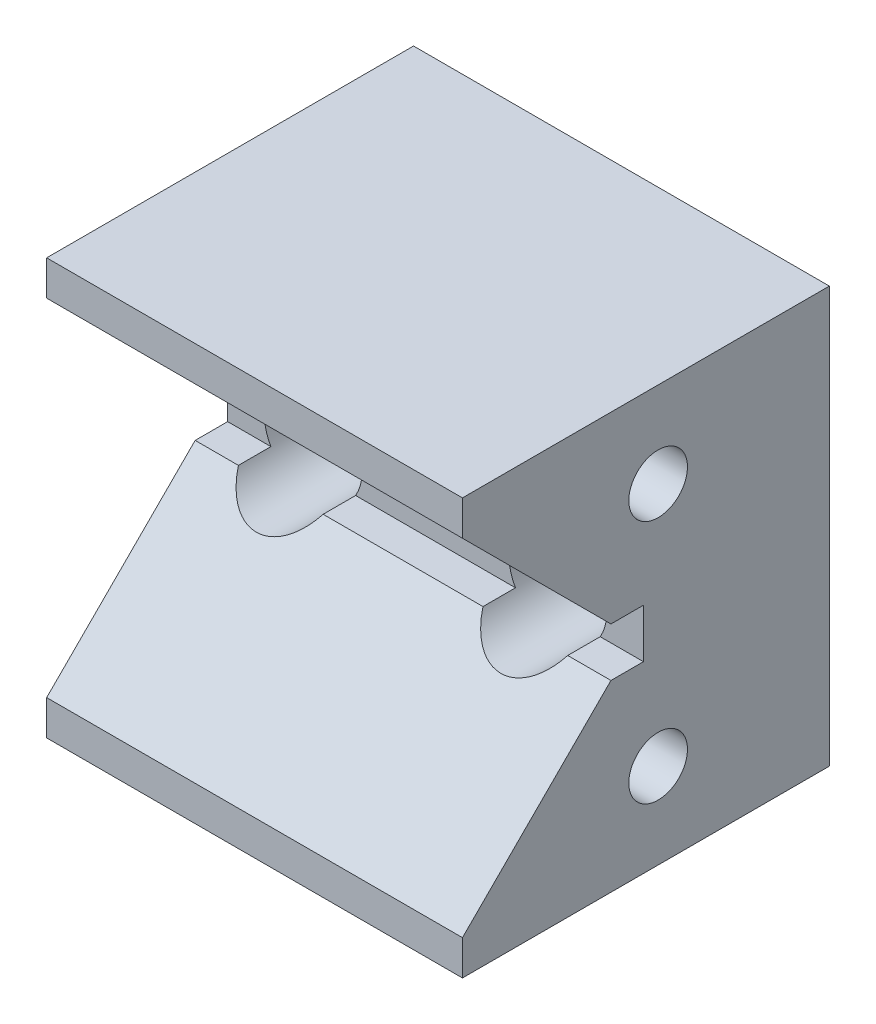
ISO-10303-21;
HEADER;
FILE_DESCRIPTION(('STEP AP214'),'2;1');
FILE_NAME('part.step','',(''),(''),'','','');
FILE_SCHEMA(('AUTOMOTIVE_DESIGN { 1 0 10303 214 1 1 1 1 }'));
ENDSEC;
DATA;
#1=APPLICATION_CONTEXT('core data for automotive mechanical design processes');
#2=APPLICATION_PROTOCOL_DEFINITION('international standard','automotive_design',2000,#1);
#3=PRODUCT_CONTEXT('',#1,'mechanical');
#4=PRODUCT('Part','Part','',(#3));
#5=PRODUCT_RELATED_PRODUCT_CATEGORY('part','',(#4));
#6=PRODUCT_DEFINITION_FORMATION('','',#4);
#7=PRODUCT_DEFINITION_CONTEXT('part definition',#1,'design');
#8=PRODUCT_DEFINITION('design','',#6,#7);
#9=PRODUCT_DEFINITION_SHAPE('','',#8);
#10=(LENGTH_UNIT() NAMED_UNIT(*) SI_UNIT(.MILLI.,.METRE.));
#11=(NAMED_UNIT(*) PLANE_ANGLE_UNIT() SI_UNIT($,.RADIAN.));
#12=(NAMED_UNIT(*) SI_UNIT($,.STERADIAN.) SOLID_ANGLE_UNIT());
#13=UNCERTAINTY_MEASURE_WITH_UNIT(LENGTH_MEASURE(1.E-05),#10,'distance_accuracy_value','');
#14=(GEOMETRIC_REPRESENTATION_CONTEXT(3) GLOBAL_UNCERTAINTY_ASSIGNED_CONTEXT((#13)) GLOBAL_UNIT_ASSIGNED_CONTEXT((#10,
#11,#12)) REPRESENTATION_CONTEXT('',''));
#15=CARTESIAN_POINT('',(0.,0.,0.));
#16=DIRECTION('',(0.,0.,1.));
#17=DIRECTION('',(1.,0.,0.));
#18=AXIS2_PLACEMENT_3D('',#15,#16,#17);
#19=CARTESIAN_POINT('',(67.5,-42.5,0.));
#20=DIRECTION('',(0.,0.,1.));
#21=DIRECTION('',(0.,-1.,0.));
#22=AXIS2_PLACEMENT_3D('',#19,#20,#21);
#23=PLANE('',#22);
#24=CARTESIAN_POINT('',(50.,0.,0.));
#25=DIRECTION('',(0.,0.,-1.));
#26=DIRECTION('',(0.,1.,0.));
#27=AXIS2_PLACEMENT_3D('',#24,#25,#26);
#28=CIRCLE('',#27,6.);
#29=CARTESIAN_POINT('',(50.,6.,0.));
#30=VERTEX_POINT('',#29);
#31=EDGE_CURVE('E272',#30,#30,#28,.T.);
#32=ORIENTED_EDGE('',*,*,#31,.F.);
#33=EDGE_LOOP('',(#32));
#34=FACE_BOUND('',#33,.T.);
#35=DIRECTION('',(-1.,0.,0.));
#36=VECTOR('',#35,1.);
#37=CARTESIAN_POINT('',(67.5,42.5,0.));
#38=LINE('',#37,#36);
#39=CARTESIAN_POINT('',(67.5,42.5,0.));
#40=VERTEX_POINT('',#39);
#41=CARTESIAN_POINT('',(-17.5,42.5,0.));
#42=VERTEX_POINT('',#41);
#43=EDGE_CURVE('E178',#40,#42,#38,.T.);
#44=ORIENTED_EDGE('',*,*,#43,.F.);
#45=DIRECTION('',(0.,1.,0.));
#46=VECTOR('',#45,1.);
#47=CARTESIAN_POINT('',(67.5,-42.5,0.));
#48=LINE('',#47,#46);
#49=CARTESIAN_POINT('',(67.5,-42.5,0.));
#50=VERTEX_POINT('',#49);
#51=EDGE_CURVE('E235',#50,#40,#48,.T.);
#52=ORIENTED_EDGE('',*,*,#51,.F.);
#53=DIRECTION('',(-1.,0.,0.));
#54=VECTOR('',#53,1.);
#55=CARTESIAN_POINT('',(67.5,-42.5,0.));
#56=LINE('',#55,#54);
#57=CARTESIAN_POINT('',(-17.5,-42.5,0.));
#58=VERTEX_POINT('',#57);
#59=EDGE_CURVE('E180',#50,#58,#56,.T.);
#60=ORIENTED_EDGE('',*,*,#59,.T.);
#61=DIRECTION('',(0.,1.,0.));
#62=VECTOR('',#61,1.);
#63=CARTESIAN_POINT('',(-17.5,-42.5,0.));
#64=LINE('',#63,#62);
#65=EDGE_CURVE('E207',#58,#42,#64,.T.);
#66=ORIENTED_EDGE('',*,*,#65,.T.);
#67=EDGE_LOOP('',(#44,#52,#60,#66));
#68=FACE_BOUND('',#67,.T.);
#69=CARTESIAN_POINT('',(0.,0.,0.));
#70=DIRECTION('',(0.,0.,-1.));
#71=DIRECTION('',(0.,1.,0.));
#72=AXIS2_PLACEMENT_3D('',#69,#70,#71);
#73=CIRCLE('',#72,6.);
#74=CARTESIAN_POINT('',(0.,6.,0.));
#75=VERTEX_POINT('',#74);
#76=EDGE_CURVE('E310',#75,#75,#73,.T.);
#77=ORIENTED_EDGE('',*,*,#76,.F.);
#78=EDGE_LOOP('',(#77));
#79=FACE_BOUND('',#78,.T.);
#80=ADVANCED_FACE('F14',(#34,#68,#79),#23,.F.);
#81=CARTESIAN_POINT('',(67.5,35.355,75.));
#82=DIRECTION('',(0.,0.707106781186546,-0.707106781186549));
#83=DIRECTION('',(0.,0.707106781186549,0.707106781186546));
#84=AXIS2_PLACEMENT_3D('',#81,#82,#83);
#85=PLANE('',#84);
#86=CARTESIAN_POINT('',(0.,0.,39.645));
#87=DIRECTION('',(0.,0.707106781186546,-0.707106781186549));
#88=DIRECTION('',(0.,-0.707106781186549,-0.707106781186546));
#89=AXIS2_PLACEMENT_3D('',#86,#87,#88);
#90=ELLIPSE('',#89,14.1421356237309,10.);
#91=CARTESIAN_POINT('',(8.6602540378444,5.,44.645));
#92=VERTEX_POINT('',#91);
#93=CARTESIAN_POINT('',(-8.6602540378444,5.,44.645));
#94=VERTEX_POINT('',#93);
#95=EDGE_CURVE('E328',#92,#94,#90,.F.);
#96=ORIENTED_EDGE('',*,*,#95,.F.);
#97=DIRECTION('',(-1.,0.,0.));
#98=VECTOR('',#97,1.);
#99=CARTESIAN_POINT('',(67.5,5.,44.645));
#100=LINE('',#99,#98);
#101=CARTESIAN_POINT('',(41.3397459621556,5.,44.645));
#102=VERTEX_POINT('',#101);
#103=EDGE_CURVE('E174',#102,#92,#100,.T.);
#104=ORIENTED_EDGE('',*,*,#103,.F.);
#105=CARTESIAN_POINT('',(50.,0.,39.645));
#106=DIRECTION('',(0.,0.707106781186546,-0.707106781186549));
#107=DIRECTION('',(0.,-0.707106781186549,-0.707106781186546));
#108=AXIS2_PLACEMENT_3D('',#105,#106,#107);
#109=ELLIPSE('',#108,14.1421356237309,10.);
#110=CARTESIAN_POINT('',(58.6602540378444,5.,44.645));
#111=VERTEX_POINT('',#110);
#112=EDGE_CURVE('E201',#111,#102,#109,.F.);
#113=ORIENTED_EDGE('',*,*,#112,.F.);
#114=CARTESIAN_POINT('',(67.5,5.,44.645));
#115=VERTEX_POINT('',#114);
#116=EDGE_CURVE('E170',#115,#111,#100,.T.);
#117=ORIENTED_EDGE('',*,*,#116,.F.);
#118=DIRECTION('',(0.,-0.707106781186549,-0.707106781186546));
#119=VECTOR('',#118,1.);
#120=CARTESIAN_POINT('',(67.5,35.355,75.));
#121=LINE('',#120,#119);
#122=CARTESIAN_POINT('',(67.5,35.355,75.));
#123=VERTEX_POINT('',#122);
#124=EDGE_CURVE('E244',#123,#115,#121,.T.);
#125=ORIENTED_EDGE('',*,*,#124,.F.);
#126=DIRECTION('',(-1.,0.,0.));
#127=VECTOR('',#126,1.);
#128=CARTESIAN_POINT('',(67.5,35.355,75.));
#129=LINE('',#128,#127);
#130=CARTESIAN_POINT('',(-17.5,35.355,75.));
#131=VERTEX_POINT('',#130);
#132=EDGE_CURVE('E173',#123,#131,#129,.T.);
#133=ORIENTED_EDGE('',*,*,#132,.T.);
#134=DIRECTION('',(0.,-0.707106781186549,-0.707106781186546));
#135=VECTOR('',#134,1.);
#136=CARTESIAN_POINT('',(-17.5,35.355,75.));
#137=LINE('',#136,#135);
#138=CARTESIAN_POINT('',(-17.5,5.,44.645));
#139=VERTEX_POINT('',#138);
#140=EDGE_CURVE('E221',#131,#139,#137,.T.);
#141=ORIENTED_EDGE('',*,*,#140,.T.);
#142=EDGE_CURVE('E168',#94,#139,#100,.T.);
#143=ORIENTED_EDGE('',*,*,#142,.F.);
#144=EDGE_LOOP('',(#96,#104,#113,#117,#125,#133,#141,#143));
#145=FACE_BOUND('',#144,.T.);
#146=ADVANCED_FACE('F289',(#145),#85,.F.);
#147=CARTESIAN_POINT('',(67.5,5.,38.));
#148=DIRECTION('',(0.,-1.,0.));
#149=DIRECTION('',(0.,0.,-1.));
#150=AXIS2_PLACEMENT_3D('',#147,#148,#149);
#151=PLANE('',#150);
#152=DIRECTION('',(-1.,0.,0.));
#153=VECTOR('',#152,1.);
#154=CARTESIAN_POINT('',(67.5,5.,38.));
#155=LINE('',#154,#153);
#156=CARTESIAN_POINT('',(-8.6602540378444,5.,38.));
#157=VERTEX_POINT('',#156);
#158=CARTESIAN_POINT('',(-17.5,5.,38.));
#159=VERTEX_POINT('',#158);
#160=EDGE_CURVE('E164',#157,#159,#155,.T.);
#161=ORIENTED_EDGE('',*,*,#160,.F.);
#162=DIRECTION('',(0.,0.,-1.));
#163=VECTOR('',#162,1.);
#164=CARTESIAN_POINT('',(-8.6602540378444,5.,0.));
#165=LINE('',#164,#163);
#166=EDGE_CURVE('E325',#157,#94,#165,.F.);
#167=ORIENTED_EDGE('',*,*,#166,.T.);
#168=ORIENTED_EDGE('',*,*,#142,.T.);
#169=DIRECTION('',(0.,0.,1.));
#170=VECTOR('',#169,1.);
#171=CARTESIAN_POINT('',(-17.5,5.,38.));
#172=LINE('',#171,#170);
#173=EDGE_CURVE('E224',#159,#139,#172,.T.);
#174=ORIENTED_EDGE('',*,*,#173,.F.);
#175=EDGE_LOOP('',(#161,#167,#168,#174));
#176=FACE_BOUND('',#175,.T.);
#177=ADVANCED_FACE('F378',(#176),#151,.T.);
#178=ORIENTED_EDGE('',*,*,#103,.T.);
#179=DIRECTION('',(0.,0.,-1.));
#180=VECTOR('',#179,1.);
#181=CARTESIAN_POINT('',(8.6602540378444,5.,0.));
#182=LINE('',#181,#180);
#183=CARTESIAN_POINT('',(8.6602540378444,5.,38.));
#184=VERTEX_POINT('',#183);
#185=EDGE_CURVE('E322',#92,#184,#182,.T.);
#186=ORIENTED_EDGE('',*,*,#185,.T.);
#187=CARTESIAN_POINT('',(41.3397459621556,5.,38.));
#188=VERTEX_POINT('',#187);
#189=EDGE_CURVE('E169',#188,#184,#155,.T.);
#190=ORIENTED_EDGE('',*,*,#189,.F.);
#191=DIRECTION('',(0.,0.,-1.));
#192=VECTOR('',#191,1.);
#193=CARTESIAN_POINT('',(41.3397459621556,5.,0.));
#194=LINE('',#193,#192);
#195=EDGE_CURVE('E278',#188,#102,#194,.F.);
#196=ORIENTED_EDGE('',*,*,#195,.T.);
#197=EDGE_LOOP('',(#178,#186,#190,#196));
#198=FACE_BOUND('',#197,.T.);
#199=ADVANCED_FACE('F376',(#198),#151,.T.);
#200=CARTESIAN_POINT('',(67.5,-5.,38.));
#201=DIRECTION('',(0.,0.,1.));
#202=DIRECTION('',(0.,-1.,0.));
#203=AXIS2_PLACEMENT_3D('',#200,#201,#202);
#204=PLANE('',#203);
#205=DIRECTION('',(-1.,0.,0.));
#206=VECTOR('',#205,1.);
#207=CARTESIAN_POINT('',(67.5,-5.,38.));
#208=LINE('',#207,#206);
#209=CARTESIAN_POINT('',(-8.66025403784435,-5.00000000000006,38.));
#210=VERTEX_POINT('',#209);
#211=CARTESIAN_POINT('',(-17.5,-5.,38.));
#212=VERTEX_POINT('',#211);
#213=EDGE_CURVE('E156',#210,#212,#208,.T.);
#214=ORIENTED_EDGE('',*,*,#213,.F.);
#215=CARTESIAN_POINT('',(0.,0.,38.));
#216=DIRECTION('',(0.,0.,1.));
#217=DIRECTION('',(0.,-1.,0.));
#218=AXIS2_PLACEMENT_3D('',#215,#216,#217);
#219=CIRCLE('',#218,10.);
#220=EDGE_CURVE('E321',#210,#157,#219,.F.);
#221=ORIENTED_EDGE('',*,*,#220,.T.);
#222=ORIENTED_EDGE('',*,*,#160,.T.);
#223=DIRECTION('',(0.,1.,0.));
#224=VECTOR('',#223,1.);
#225=CARTESIAN_POINT('',(-17.5,-5.,38.));
#226=LINE('',#225,#224);
#227=EDGE_CURVE('E227',#212,#159,#226,.T.);
#228=ORIENTED_EDGE('',*,*,#227,.F.);
#229=EDGE_LOOP('',(#214,#221,#222,#228));
#230=FACE_BOUND('',#229,.T.);
#231=ADVANCED_FACE('F372',(#230),#204,.T.);
#232=ORIENTED_EDGE('',*,*,#189,.T.);
#233=CARTESIAN_POINT('',(8.66025403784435,-5.00000000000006,38.));
#234=VERTEX_POINT('',#233);
#235=EDGE_CURVE('E149',#184,#234,#219,.F.);
#236=ORIENTED_EDGE('',*,*,#235,.T.);
#237=CARTESIAN_POINT('',(41.3397459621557,-5.00000000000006,38.));
#238=VERTEX_POINT('',#237);
#239=EDGE_CURVE('E148',#238,#234,#208,.T.);
#240=ORIENTED_EDGE('',*,*,#239,.F.);
#241=CARTESIAN_POINT('',(50.,0.,38.));
#242=DIRECTION('',(0.,0.,1.));
#243=DIRECTION('',(0.,-1.,0.));
#244=AXIS2_PLACEMENT_3D('',#241,#242,#243);
#245=CIRCLE('',#244,10.);
#246=EDGE_CURVE('E270',#238,#188,#245,.F.);
#247=ORIENTED_EDGE('',*,*,#246,.T.);
#248=EDGE_LOOP('',(#232,#236,#240,#247));
#249=FACE_BOUND('',#248,.T.);
#250=ADVANCED_FACE('F375',(#249),#204,.T.);
#251=CARTESIAN_POINT('',(67.5,-5.,44.645));
#252=DIRECTION('',(0.,1.,0.));
#253=DIRECTION('',(0.,0.,1.));
#254=AXIS2_PLACEMENT_3D('',#251,#252,#253);
#255=PLANE('',#254);
#256=ORIENTED_EDGE('',*,*,#239,.T.);
#257=DIRECTION('',(0.,0.,-1.));
#258=VECTOR('',#257,1.);
#259=CARTESIAN_POINT('',(8.66025403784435,-5.00000000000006,0.));
#260=LINE('',#259,#258);
#261=CARTESIAN_POINT('',(8.6602540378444,-5.,44.645));
#262=VERTEX_POINT('',#261);
#263=EDGE_CURVE('E137',#234,#262,#260,.F.);
#264=ORIENTED_EDGE('',*,*,#263,.T.);
#265=DIRECTION('',(-1.,0.,0.));
#266=VECTOR('',#265,1.);
#267=CARTESIAN_POINT('',(67.5,-5.,44.645));
#268=LINE('',#267,#266);
#269=CARTESIAN_POINT('',(41.3397459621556,-5.,44.645));
#270=VERTEX_POINT('',#269);
#271=EDGE_CURVE('E146',#270,#262,#268,.T.);
#272=ORIENTED_EDGE('',*,*,#271,.F.);
#273=DIRECTION('',(0.,0.,-1.));
#274=VECTOR('',#273,1.);
#275=CARTESIAN_POINT('',(41.3397459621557,-5.00000000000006,0.));
#276=LINE('',#275,#274);
#277=EDGE_CURVE('E36',#270,#238,#276,.T.);
#278=ORIENTED_EDGE('',*,*,#277,.T.);
#279=EDGE_LOOP('',(#256,#264,#272,#278));
#280=FACE_BOUND('',#279,.T.);
#281=ADVANCED_FACE('F145',(#280),#255,.T.);
#282=CARTESIAN_POINT('',(-8.6602540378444,-5.,44.645));
#283=VERTEX_POINT('',#282);
#284=CARTESIAN_POINT('',(-17.5,-5.,44.645));
#285=VERTEX_POINT('',#284);
#286=EDGE_CURVE('E154',#283,#285,#268,.T.);
#287=ORIENTED_EDGE('',*,*,#286,.F.);
#288=DIRECTION('',(0.,0.,-1.));
#289=VECTOR('',#288,1.);
#290=CARTESIAN_POINT('',(-8.66025403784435,-5.00000000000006,0.));
#291=LINE('',#290,#289);
#292=EDGE_CURVE('E29',#283,#210,#291,.T.);
#293=ORIENTED_EDGE('',*,*,#292,.T.);
#294=ORIENTED_EDGE('',*,*,#213,.T.);
#295=DIRECTION('',(0.,0.,-1.));
#296=VECTOR('',#295,1.);
#297=CARTESIAN_POINT('',(-17.5,-5.,44.645));
#298=LINE('',#297,#296);
#299=EDGE_CURVE('E230',#285,#212,#298,.T.);
#300=ORIENTED_EDGE('',*,*,#299,.F.);
#301=EDGE_LOOP('',(#287,#293,#294,#300));
#302=FACE_BOUND('',#301,.T.);
#303=ADVANCED_FACE('F368',(#302),#255,.T.);
#304=CARTESIAN_POINT('',(67.5,-35.355,75.));
#305=DIRECTION('',(0.,0.707106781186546,0.707106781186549));
#306=DIRECTION('',(0.,-0.707106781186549,0.707106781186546));
#307=AXIS2_PLACEMENT_3D('',#304,#305,#306);
#308=PLANE('',#307);
#309=ORIENTED_EDGE('',*,*,#271,.T.);
#310=CARTESIAN_POINT('',(0.,0.,39.645));
#311=DIRECTION('',(0.,0.707106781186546,0.707106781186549));
#312=DIRECTION('',(0.,0.707106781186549,-0.707106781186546));
#313=AXIS2_PLACEMENT_3D('',#310,#311,#312);
#314=ELLIPSE('',#313,14.1421356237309,10.);
#315=EDGE_CURVE('E9',#262,#283,#314,.F.);
#316=ORIENTED_EDGE('',*,*,#315,.T.);
#317=ORIENTED_EDGE('',*,*,#286,.T.);
#318=DIRECTION('',(0.,0.707106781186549,-0.707106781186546));
#319=VECTOR('',#318,1.);
#320=CARTESIAN_POINT('',(-17.5,-35.355,75.));
#321=LINE('',#320,#319);
#322=CARTESIAN_POINT('',(-17.5,-35.355,75.));
#323=VERTEX_POINT('',#322);
#324=EDGE_CURVE('E200',#323,#285,#321,.T.);
#325=ORIENTED_EDGE('',*,*,#324,.F.);
#326=DIRECTION('',(-1.,0.,0.));
#327=VECTOR('',#326,1.);
#328=CARTESIAN_POINT('',(67.5,-35.355,75.));
#329=LINE('',#328,#327);
#330=CARTESIAN_POINT('',(67.5,-35.355,75.));
#331=VERTEX_POINT('',#330);
#332=EDGE_CURVE('E157',#331,#323,#329,.T.);
#333=ORIENTED_EDGE('',*,*,#332,.F.);
#334=DIRECTION('',(0.,0.707106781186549,-0.707106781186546));
#335=VECTOR('',#334,1.);
#336=CARTESIAN_POINT('',(67.5,-35.355,75.));
#337=LINE('',#336,#335);
#338=CARTESIAN_POINT('',(67.5,-5.,44.645));
#339=VERTEX_POINT('',#338);
#340=EDGE_CURVE('E210',#331,#339,#337,.T.);
#341=ORIENTED_EDGE('',*,*,#340,.T.);
#342=CARTESIAN_POINT('',(58.6602540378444,-5.,44.645));
#343=VERTEX_POINT('',#342);
#344=EDGE_CURVE('E153',#339,#343,#268,.T.);
#345=ORIENTED_EDGE('',*,*,#344,.T.);
#346=CARTESIAN_POINT('',(50.,0.,39.645));
#347=DIRECTION('',(0.,0.707106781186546,0.707106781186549));
#348=DIRECTION('',(0.,0.707106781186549,-0.707106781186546));
#349=AXIS2_PLACEMENT_3D('',#346,#347,#348);
#350=ELLIPSE('',#349,14.1421356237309,10.);
#351=EDGE_CURVE('E22',#343,#270,#350,.F.);
#352=ORIENTED_EDGE('',*,*,#351,.T.);
#353=EDGE_LOOP('',(#309,#316,#317,#325,#333,#341,#345,#352));
#354=FACE_BOUND('',#353,.T.);
#355=ADVANCED_FACE('F151',(#354),#308,.T.);
#356=ORIENTED_EDGE('',*,*,#116,.T.);
#357=DIRECTION('',(0.,0.,-1.));
#358=VECTOR('',#357,1.);
#359=CARTESIAN_POINT('',(58.6602540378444,5.,0.));
#360=LINE('',#359,#358);
#361=CARTESIAN_POINT('',(58.6602540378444,5.,38.));
#362=VERTEX_POINT('',#361);
#363=EDGE_CURVE('E276',#111,#362,#360,.T.);
#364=ORIENTED_EDGE('',*,*,#363,.T.);
#365=CARTESIAN_POINT('',(67.5,5.,38.));
#366=VERTEX_POINT('',#365);
#367=EDGE_CURVE('E165',#366,#362,#155,.T.);
#368=ORIENTED_EDGE('',*,*,#367,.F.);
#369=DIRECTION('',(0.,0.,1.));
#370=VECTOR('',#369,1.);
#371=CARTESIAN_POINT('',(67.5,5.,38.));
#372=LINE('',#371,#370);
#373=EDGE_CURVE('E247',#366,#115,#372,.T.);
#374=ORIENTED_EDGE('',*,*,#373,.T.);
#375=EDGE_LOOP('',(#356,#364,#368,#374));
#376=FACE_BOUND('',#375,.T.);
#377=ADVANCED_FACE('F292',(#376),#151,.T.);
#378=ORIENTED_EDGE('',*,*,#367,.T.);
#379=CARTESIAN_POINT('',(58.6602540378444,-5.00000000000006,38.));
#380=VERTEX_POINT('',#379);
#381=EDGE_CURVE('E268',#362,#380,#245,.F.);
#382=ORIENTED_EDGE('',*,*,#381,.T.);
#383=CARTESIAN_POINT('',(67.5,-5.,38.));
#384=VERTEX_POINT('',#383);
#385=EDGE_CURVE('E161',#384,#380,#208,.T.);
#386=ORIENTED_EDGE('',*,*,#385,.F.);
#387=DIRECTION('',(0.,1.,0.));
#388=VECTOR('',#387,1.);
#389=CARTESIAN_POINT('',(67.5,-5.,38.));
#390=LINE('',#389,#388);
#391=EDGE_CURVE('E250',#384,#366,#390,.T.);
#392=ORIENTED_EDGE('',*,*,#391,.T.);
#393=EDGE_LOOP('',(#378,#382,#386,#392));
#394=FACE_BOUND('',#393,.T.);
#395=ADVANCED_FACE('F371',(#394),#204,.T.);
#396=ORIENTED_EDGE('',*,*,#385,.T.);
#397=DIRECTION('',(0.,0.,-1.));
#398=VECTOR('',#397,1.);
#399=CARTESIAN_POINT('',(58.6602540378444,-5.00000000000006,0.));
#400=LINE('',#399,#398);
#401=EDGE_CURVE('E266',#380,#343,#400,.F.);
#402=ORIENTED_EDGE('',*,*,#401,.T.);
#403=ORIENTED_EDGE('',*,*,#344,.F.);
#404=DIRECTION('',(0.,0.,-1.));
#405=VECTOR('',#404,1.);
#406=CARTESIAN_POINT('',(67.5,-5.,44.645));
#407=LINE('',#406,#405);
#408=EDGE_CURVE('E253',#339,#384,#407,.T.);
#409=ORIENTED_EDGE('',*,*,#408,.T.);
#410=EDGE_LOOP('',(#396,#402,#403,#409));
#411=FACE_BOUND('',#410,.T.);
#412=ADVANCED_FACE('F264',(#411),#255,.T.);
#413=CARTESIAN_POINT('',(67.5,-42.5,75.));
#414=DIRECTION('',(0.,0.,1.));
#415=DIRECTION('',(0.,-1.,0.));
#416=AXIS2_PLACEMENT_3D('',#413,#414,#415);
#417=PLANE('',#416);
#418=DIRECTION('',(-1.,0.,0.));
#419=VECTOR('',#418,1.);
#420=CARTESIAN_POINT('',(67.5,-42.5,75.));
#421=LINE('',#420,#419);
#422=CARTESIAN_POINT('',(67.5,-42.5,75.));
#423=VERTEX_POINT('',#422);
#424=CARTESIAN_POINT('',(-17.5,-42.5,75.));
#425=VERTEX_POINT('',#424);
#426=EDGE_CURVE('E182',#423,#425,#421,.T.);
#427=ORIENTED_EDGE('',*,*,#426,.F.);
#428=DIRECTION('',(0.,1.,0.));
#429=VECTOR('',#428,1.);
#430=CARTESIAN_POINT('',(67.5,-42.5,75.));
#431=LINE('',#430,#429);
#432=EDGE_CURVE('E208',#423,#331,#431,.T.);
#433=ORIENTED_EDGE('',*,*,#432,.T.);
#434=ORIENTED_EDGE('',*,*,#332,.T.);
#435=DIRECTION('',(0.,1.,0.));
#436=VECTOR('',#435,1.);
#437=CARTESIAN_POINT('',(-17.5,-42.5,75.));
#438=LINE('',#437,#436);
#439=EDGE_CURVE('E195',#425,#323,#438,.T.);
#440=ORIENTED_EDGE('',*,*,#439,.F.);
#441=EDGE_LOOP('',(#427,#433,#434,#440));
#442=FACE_BOUND('',#441,.T.);
#443=ADVANCED_FACE('F196',(#442),#417,.T.);
#444=CARTESIAN_POINT('',(67.5,-42.5,75.));
#445=DIRECTION('',(0.,1.,0.));
#446=DIRECTION('',(0.,0.,1.));
#447=AXIS2_PLACEMENT_3D('',#444,#445,#446);
#448=PLANE('',#447);
#449=ORIENTED_EDGE('',*,*,#59,.F.);
#450=DIRECTION('',(0.,0.,-1.));
#451=VECTOR('',#450,1.);
#452=CARTESIAN_POINT('',(67.5,-42.5,75.));
#453=LINE('',#452,#451);
#454=EDGE_CURVE('E190',#423,#50,#453,.T.);
#455=ORIENTED_EDGE('',*,*,#454,.F.);
#456=ORIENTED_EDGE('',*,*,#426,.T.);
#457=DIRECTION('',(0.,0.,-1.));
#458=VECTOR('',#457,1.);
#459=CARTESIAN_POINT('',(-17.5,-42.5,75.));
#460=LINE('',#459,#458);
#461=EDGE_CURVE('E188',#425,#58,#460,.T.);
#462=ORIENTED_EDGE('',*,*,#461,.T.);
#463=EDGE_LOOP('',(#449,#455,#456,#462));
#464=FACE_BOUND('',#463,.T.);
#465=ADVANCED_FACE('F16',(#464),#448,.F.);
#466=CARTESIAN_POINT('',(67.5,42.5,0.));
#467=DIRECTION('',(0.,-1.,0.));
#468=DIRECTION('',(0.,0.,-1.));
#469=AXIS2_PLACEMENT_3D('',#466,#467,#468);
#470=PLANE('',#469);
#471=DIRECTION('',(-1.,0.,0.));
#472=VECTOR('',#471,1.);
#473=CARTESIAN_POINT('',(67.5,42.5,75.));
#474=LINE('',#473,#472);
#475=CARTESIAN_POINT('',(67.5,42.5,75.));
#476=VERTEX_POINT('',#475);
#477=CARTESIAN_POINT('',(-17.5,42.5,75.));
#478=VERTEX_POINT('',#477);
#479=EDGE_CURVE('E176',#476,#478,#474,.T.);
#480=ORIENTED_EDGE('',*,*,#479,.F.);
#481=DIRECTION('',(0.,0.,1.));
#482=VECTOR('',#481,1.);
#483=CARTESIAN_POINT('',(67.5,42.5,0.));
#484=LINE('',#483,#482);
#485=EDGE_CURVE('E238',#40,#476,#484,.T.);
#486=ORIENTED_EDGE('',*,*,#485,.F.);
#487=ORIENTED_EDGE('',*,*,#43,.T.);
#488=DIRECTION('',(0.,0.,1.));
#489=VECTOR('',#488,1.);
#490=CARTESIAN_POINT('',(-17.5,42.5,0.));
#491=LINE('',#490,#489);
#492=EDGE_CURVE('E211',#42,#478,#491,.T.);
#493=ORIENTED_EDGE('',*,*,#492,.T.);
#494=EDGE_LOOP('',(#480,#486,#487,#493));
#495=FACE_BOUND('',#494,.T.);
#496=ADVANCED_FACE('F302',(#495),#470,.F.);
#497=CARTESIAN_POINT('',(67.5,42.5,75.));
#498=DIRECTION('',(0.,0.,-1.));
#499=DIRECTION('',(0.,1.,0.));
#500=AXIS2_PLACEMENT_3D('',#497,#498,#499);
#501=PLANE('',#500);
#502=ORIENTED_EDGE('',*,*,#132,.F.);
#503=DIRECTION('',(0.,-1.,0.));
#504=VECTOR('',#503,1.);
#505=CARTESIAN_POINT('',(67.5,42.5,75.));
#506=LINE('',#505,#504);
#507=EDGE_CURVE('E241',#476,#123,#506,.T.);
#508=ORIENTED_EDGE('',*,*,#507,.F.);
#509=ORIENTED_EDGE('',*,*,#479,.T.);
#510=DIRECTION('',(0.,-1.,0.));
#511=VECTOR('',#510,1.);
#512=CARTESIAN_POINT('',(-17.5,42.5,75.));
#513=LINE('',#512,#511);
#514=EDGE_CURVE('E218',#478,#131,#513,.T.);
#515=ORIENTED_EDGE('',*,*,#514,.T.);
#516=EDGE_LOOP('',(#502,#508,#509,#515));
#517=FACE_BOUND('',#516,.T.);
#518=ADVANCED_FACE('F299',(#517),#501,.F.);
#519=CARTESIAN_POINT('',(67.5,-42.5,75.));
#520=DIRECTION('',(-1.,0.,0.));
#521=DIRECTION('',(0.,0.,-1.));
#522=AXIS2_PLACEMENT_3D('',#519,#520,#521);
#523=PLANE('',#522);
#524=CARTESIAN_POINT('',(67.5,-25.,35.));
#525=DIRECTION('',(1.,0.,0.));
#526=DIRECTION('',(0.,0.,1.));
#527=AXIS2_PLACEMENT_3D('',#524,#525,#526);
#528=CIRCLE('',#527,6.);
#529=CARTESIAN_POINT('',(67.5,-25.,41.));
#530=VERTEX_POINT('',#529);
#531=EDGE_CURVE('E594',#530,#530,#528,.T.);
#532=ORIENTED_EDGE('',*,*,#531,.F.);
#533=EDGE_LOOP('',(#532));
#534=FACE_BOUND('',#533,.T.);
#535=CARTESIAN_POINT('',(67.5,25.,35.));
#536=DIRECTION('',(1.,0.,0.));
#537=DIRECTION('',(0.,0.,1.));
#538=AXIS2_PLACEMENT_3D('',#535,#536,#537);
#539=CIRCLE('',#538,6.);
#540=CARTESIAN_POINT('',(67.5,25.,41.));
#541=VERTEX_POINT('',#540);
#542=EDGE_CURVE('E593',#541,#541,#539,.T.);
#543=ORIENTED_EDGE('',*,*,#542,.F.);
#544=EDGE_LOOP('',(#543));
#545=FACE_BOUND('',#544,.T.);
#546=ORIENTED_EDGE('',*,*,#432,.F.);
#547=ORIENTED_EDGE('',*,*,#454,.T.);
#548=ORIENTED_EDGE('',*,*,#51,.T.);
#549=ORIENTED_EDGE('',*,*,#485,.T.);
#550=ORIENTED_EDGE('',*,*,#507,.T.);
#551=ORIENTED_EDGE('',*,*,#124,.T.);
#552=ORIENTED_EDGE('',*,*,#373,.F.);
#553=ORIENTED_EDGE('',*,*,#391,.F.);
#554=ORIENTED_EDGE('',*,*,#408,.F.);
#555=ORIENTED_EDGE('',*,*,#340,.F.);
#556=EDGE_LOOP('',(#546,#547,#548,#549,#550,#551,#552,#553,#554,#555));
#557=FACE_BOUND('',#556,.T.);
#558=ADVANCED_FACE('F261',(#534,#545,#557),#523,.F.);
#559=CARTESIAN_POINT('',(-17.5,-42.5,75.));
#560=DIRECTION('',(-1.,0.,0.));
#561=DIRECTION('',(0.,0.,-1.));
#562=AXIS2_PLACEMENT_3D('',#559,#560,#561);
#563=PLANE('',#562);
#564=ORIENTED_EDGE('',*,*,#439,.T.);
#565=ORIENTED_EDGE('',*,*,#324,.T.);
#566=ORIENTED_EDGE('',*,*,#299,.T.);
#567=ORIENTED_EDGE('',*,*,#227,.T.);
#568=ORIENTED_EDGE('',*,*,#173,.T.);
#569=ORIENTED_EDGE('',*,*,#140,.F.);
#570=ORIENTED_EDGE('',*,*,#514,.F.);
#571=ORIENTED_EDGE('',*,*,#492,.F.);
#572=ORIENTED_EDGE('',*,*,#65,.F.);
#573=ORIENTED_EDGE('',*,*,#461,.F.);
#574=EDGE_LOOP('',(#564,#565,#566,#567,#568,#569,#570,#571,#572,#573));
#575=FACE_BOUND('',#574,.T.);
#576=ADVANCED_FACE('F204',(#575),#563,.T.);
#577=CARTESIAN_POINT('',(50.,0.,0.));
#578=DIRECTION('',(0.,0.,-1.));
#579=DIRECTION('',(0.,1.,0.));
#580=AXIS2_PLACEMENT_3D('',#577,#578,#579);
#581=CYLINDRICAL_SURFACE('',#580,10.);
#582=CARTESIAN_POINT('',(50.,0.,22.));
#583=DIRECTION('',(0.,0.,-1.));
#584=DIRECTION('',(0.,1.,0.));
#585=AXIS2_PLACEMENT_3D('',#582,#583,#584);
#586=CIRCLE('',#585,10.);
#587=CARTESIAN_POINT('',(50.,10.,22.));
#588=VERTEX_POINT('',#587);
#589=EDGE_CURVE('E330',#588,#588,#586,.T.);
#590=ORIENTED_EDGE('',*,*,#589,.T.);
#591=EDGE_LOOP('',(#590));
#592=FACE_BOUND('',#591,.T.);
#593=ORIENTED_EDGE('',*,*,#112,.T.);
#594=ORIENTED_EDGE('',*,*,#195,.F.);
#595=ORIENTED_EDGE('',*,*,#246,.F.);
#596=ORIENTED_EDGE('',*,*,#277,.F.);
#597=ORIENTED_EDGE('',*,*,#351,.F.);
#598=ORIENTED_EDGE('',*,*,#401,.F.);
#599=ORIENTED_EDGE('',*,*,#381,.F.);
#600=ORIENTED_EDGE('',*,*,#363,.F.);
#601=EDGE_LOOP('',(#593,#594,#595,#596,#597,#598,#599,#600));
#602=FACE_BOUND('',#601,.T.);
#603=ADVANCED_FACE('F285',(#592,#602),#581,.F.);
#604=CARTESIAN_POINT('',(50.,0.,0.));
#605=DIRECTION('',(0.,0.,-1.));
#606=DIRECTION('',(0.,1.,0.));
#607=AXIS2_PLACEMENT_3D('',#604,#605,#606);
#608=CYLINDRICAL_SURFACE('',#607,6.);
#609=ORIENTED_EDGE('',*,*,#31,.T.);
#610=EDGE_LOOP('',(#609));
#611=FACE_BOUND('',#610,.T.);
#612=CARTESIAN_POINT('',(50.,0.,22.));
#613=DIRECTION('',(0.,0.,-1.));
#614=DIRECTION('',(0.,1.,0.));
#615=AXIS2_PLACEMENT_3D('',#612,#613,#614);
#616=CIRCLE('',#615,6.);
#617=CARTESIAN_POINT('',(50.,6.,22.));
#618=VERTEX_POINT('',#617);
#619=EDGE_CURVE('E333',#618,#618,#616,.T.);
#620=ORIENTED_EDGE('',*,*,#619,.F.);
#621=EDGE_LOOP('',(#620));
#622=FACE_BOUND('',#621,.T.);
#623=ADVANCED_FACE('F338',(#611,#622),#608,.F.);
#624=CARTESIAN_POINT('',(50.,-10.,22.));
#625=DIRECTION('',(0.,0.,1.));
#626=DIRECTION('',(0.,-1.,0.));
#627=AXIS2_PLACEMENT_3D('',#624,#625,#626);
#628=PLANE('',#627);
#629=ORIENTED_EDGE('',*,*,#619,.T.);
#630=EDGE_LOOP('',(#629));
#631=FACE_BOUND('',#630,.T.);
#632=ORIENTED_EDGE('',*,*,#589,.F.);
#633=EDGE_LOOP('',(#632));
#634=FACE_BOUND('',#633,.T.);
#635=ADVANCED_FACE('F341',(#631,#634),#628,.T.);
#636=CARTESIAN_POINT('',(0.,0.,0.));
#637=DIRECTION('',(0.,0.,-1.));
#638=DIRECTION('',(0.,1.,0.));
#639=AXIS2_PLACEMENT_3D('',#636,#637,#638);
#640=CYLINDRICAL_SURFACE('',#639,10.);
#641=CARTESIAN_POINT('',(0.,0.,22.));
#642=DIRECTION('',(0.,0.,-1.));
#643=DIRECTION('',(0.,1.,0.));
#644=AXIS2_PLACEMENT_3D('',#641,#642,#643);
#645=CIRCLE('',#644,10.);
#646=CARTESIAN_POINT('',(0.,10.,22.));
#647=VERTEX_POINT('',#646);
#648=EDGE_CURVE('E316',#647,#647,#645,.T.);
#649=ORIENTED_EDGE('',*,*,#648,.T.);
#650=EDGE_LOOP('',(#649));
#651=FACE_BOUND('',#650,.T.);
#652=ORIENTED_EDGE('',*,*,#95,.T.);
#653=ORIENTED_EDGE('',*,*,#166,.F.);
#654=ORIENTED_EDGE('',*,*,#220,.F.);
#655=ORIENTED_EDGE('',*,*,#292,.F.);
#656=ORIENTED_EDGE('',*,*,#315,.F.);
#657=ORIENTED_EDGE('',*,*,#263,.F.);
#658=ORIENTED_EDGE('',*,*,#235,.F.);
#659=ORIENTED_EDGE('',*,*,#185,.F.);
#660=EDGE_LOOP('',(#652,#653,#654,#655,#656,#657,#658,#659));
#661=FACE_BOUND('',#660,.T.);
#662=ADVANCED_FACE('F136',(#651,#661),#640,.F.);
#663=CARTESIAN_POINT('',(0.,0.,0.));
#664=DIRECTION('',(0.,0.,-1.));
#665=DIRECTION('',(0.,1.,0.));
#666=AXIS2_PLACEMENT_3D('',#663,#664,#665);
#667=CYLINDRICAL_SURFACE('',#666,6.);
#668=ORIENTED_EDGE('',*,*,#76,.T.);
#669=EDGE_LOOP('',(#668));
#670=FACE_BOUND('',#669,.T.);
#671=CARTESIAN_POINT('',(0.,0.,22.));
#672=DIRECTION('',(0.,0.,-1.));
#673=DIRECTION('',(0.,1.,0.));
#674=AXIS2_PLACEMENT_3D('',#671,#672,#673);
#675=CIRCLE('',#674,6.);
#676=CARTESIAN_POINT('',(0.,6.,22.));
#677=VERTEX_POINT('',#676);
#678=EDGE_CURVE('E312',#677,#677,#675,.T.);
#679=ORIENTED_EDGE('',*,*,#678,.F.);
#680=EDGE_LOOP('',(#679));
#681=FACE_BOUND('',#680,.T.);
#682=ADVANCED_FACE('F358',(#670,#681),#667,.F.);
#683=CARTESIAN_POINT('',(0.,-10.,22.));
#684=DIRECTION('',(0.,0.,1.));
#685=DIRECTION('',(0.,-1.,0.));
#686=AXIS2_PLACEMENT_3D('',#683,#684,#685);
#687=PLANE('',#686);
#688=ORIENTED_EDGE('',*,*,#678,.T.);
#689=EDGE_LOOP('',(#688));
#690=FACE_BOUND('',#689,.T.);
#691=ORIENTED_EDGE('',*,*,#648,.F.);
#692=EDGE_LOOP('',(#691));
#693=FACE_BOUND('',#692,.T.);
#694=ADVANCED_FACE('F536',(#690,#693),#687,.T.);
#695=CARTESIAN_POINT('',(37.5,25.,35.));
#696=DIRECTION('',(1.,0.,0.));
#697=DIRECTION('',(0.,0.,1.));
#698=AXIS2_PLACEMENT_3D('',#695,#696,#697);
#699=CYLINDRICAL_SURFACE('',#698,6.);
#700=CARTESIAN_POINT('',(37.5,25.,35.));
#701=DIRECTION('',(1.,0.,0.));
#702=DIRECTION('',(0.,0.,1.));
#703=AXIS2_PLACEMENT_3D('',#700,#701,#702);
#704=CIRCLE('',#703,6.);
#705=CARTESIAN_POINT('',(37.5,25.,41.));
#706=VERTEX_POINT('',#705);
#707=EDGE_CURVE('E597',#706,#706,#704,.T.);
#708=ORIENTED_EDGE('',*,*,#707,.F.);
#709=EDGE_LOOP('',(#708));
#710=FACE_BOUND('',#709,.T.);
#711=ORIENTED_EDGE('',*,*,#542,.T.);
#712=EDGE_LOOP('',(#711));
#713=FACE_BOUND('',#712,.T.);
#714=ADVANCED_FACE('F543',(#710,#713),#699,.F.);
#715=CARTESIAN_POINT('',(37.5,25.,35.));
#716=DIRECTION('',(1.,0.,0.));
#717=DIRECTION('',(0.,0.,1.));
#718=AXIS2_PLACEMENT_3D('',#715,#716,#717);
#719=PLANE('',#718);
#720=ORIENTED_EDGE('',*,*,#707,.T.);
#721=EDGE_LOOP('',(#720));
#722=FACE_BOUND('',#721,.T.);
#723=ADVANCED_FACE('F545',(#722),#719,.T.);
#724=CARTESIAN_POINT('',(37.5,-25.,35.));
#725=DIRECTION('',(1.,0.,0.));
#726=DIRECTION('',(0.,0.,1.));
#727=AXIS2_PLACEMENT_3D('',#724,#725,#726);
#728=CYLINDRICAL_SURFACE('',#727,6.);
#729=CARTESIAN_POINT('',(37.5,-25.,35.));
#730=DIRECTION('',(1.,0.,0.));
#731=DIRECTION('',(0.,0.,1.));
#732=AXIS2_PLACEMENT_3D('',#729,#730,#731);
#733=CIRCLE('',#732,6.);
#734=CARTESIAN_POINT('',(37.5,-25.,41.));
#735=VERTEX_POINT('',#734);
#736=EDGE_CURVE('E592',#735,#735,#733,.T.);
#737=ORIENTED_EDGE('',*,*,#736,.F.);
#738=EDGE_LOOP('',(#737));
#739=FACE_BOUND('',#738,.T.);
#740=ORIENTED_EDGE('',*,*,#531,.T.);
#741=EDGE_LOOP('',(#740));
#742=FACE_BOUND('',#741,.T.);
#743=ADVANCED_FACE('F561',(#739,#742),#728,.F.);
#744=CARTESIAN_POINT('',(37.5,-25.,35.));
#745=DIRECTION('',(1.,0.,0.));
#746=DIRECTION('',(0.,0.,1.));
#747=AXIS2_PLACEMENT_3D('',#744,#745,#746);
#748=PLANE('',#747);
#749=ORIENTED_EDGE('',*,*,#736,.T.);
#750=EDGE_LOOP('',(#749));
#751=FACE_BOUND('',#750,.T.);
#752=ADVANCED_FACE('F554',(#751),#748,.T.);
#753=CLOSED_SHELL('',(#80,#146,#177,#199,#231,#250,#281,#303,#355,#377,#395,#412,#443,#465,#496,
#518,#558,#576,#603,#623,#635,#662,#682,#694,#714,#723,#743,#752));
#754=MANIFOLD_SOLID_BREP('B1',#753);
#755=ADVANCED_BREP_SHAPE_REPRESENTATION('',(#18,#754),#14);
#756=SHAPE_DEFINITION_REPRESENTATION(#9,#755);
ENDSEC;
END-ISO-10303-21;
